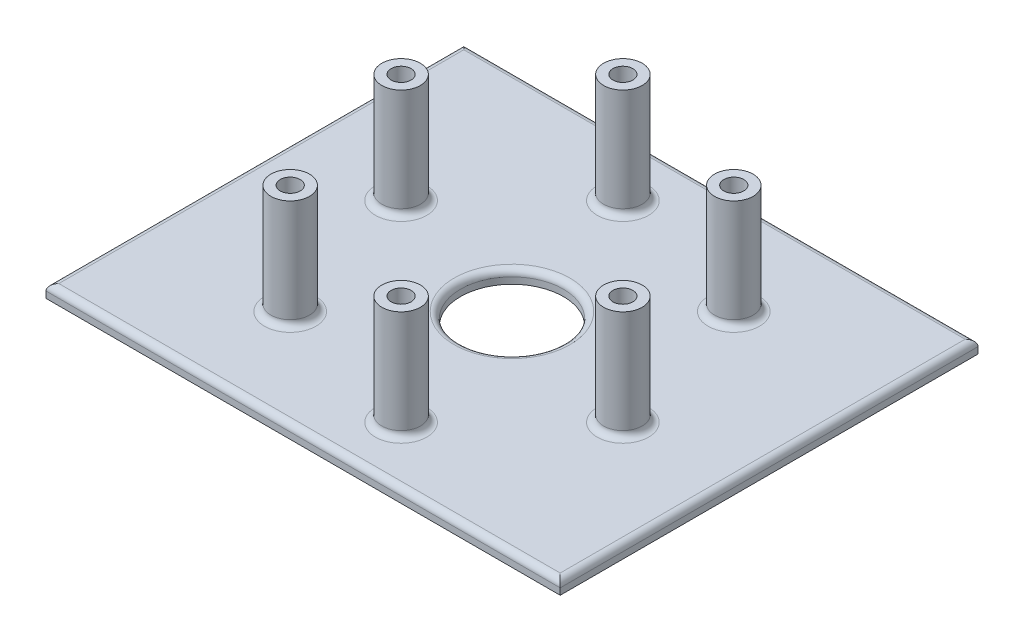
ISO-10303-21;
HEADER;
FILE_DESCRIPTION(('STEP AP214'),'2;1');
FILE_NAME('part.step','',(''),(''),'','','');
FILE_SCHEMA(('AUTOMOTIVE_DESIGN { 1 0 10303 214 1 1 1 1 }'));
ENDSEC;
DATA;
#1=APPLICATION_CONTEXT('core data for automotive mechanical design processes');
#2=APPLICATION_PROTOCOL_DEFINITION('international standard','automotive_design',2000,#1);
#3=PRODUCT_CONTEXT('',#1,'mechanical');
#4=PRODUCT('Part','Part','',(#3));
#5=PRODUCT_RELATED_PRODUCT_CATEGORY('part','',(#4));
#6=PRODUCT_DEFINITION_FORMATION('','',#4);
#7=PRODUCT_DEFINITION_CONTEXT('part definition',#1,'design');
#8=PRODUCT_DEFINITION('design','',#6,#7);
#9=PRODUCT_DEFINITION_SHAPE('','',#8);
#10=(LENGTH_UNIT() NAMED_UNIT(*) SI_UNIT(.MILLI.,.METRE.));
#11=(NAMED_UNIT(*) PLANE_ANGLE_UNIT() SI_UNIT($,.RADIAN.));
#12=(NAMED_UNIT(*) SI_UNIT($,.STERADIAN.) SOLID_ANGLE_UNIT());
#13=UNCERTAINTY_MEASURE_WITH_UNIT(LENGTH_MEASURE(1.E-05),#10,'distance_accuracy_value','');
#14=(GEOMETRIC_REPRESENTATION_CONTEXT(3) GLOBAL_UNCERTAINTY_ASSIGNED_CONTEXT((#13)) GLOBAL_UNIT_ASSIGNED_CONTEXT((#10,
#11,#12)) REPRESENTATION_CONTEXT('',''));
#15=CARTESIAN_POINT('',(0.,0.,0.));
#16=DIRECTION('',(0.,0.,1.));
#17=DIRECTION('',(1.,0.,0.));
#18=AXIS2_PLACEMENT_3D('',#15,#16,#17);
#19=CARTESIAN_POINT('',(40.,-2.,32.5));
#20=DIRECTION('',(1.,0.,0.));
#21=DIRECTION('',(0.,0.,-1.));
#22=AXIS2_PLACEMENT_3D('',#19,#20,#21);
#23=PLANE('',#22);
#24=DIRECTION('',(0.,1.,0.));
#25=VECTOR('',#24,1.);
#26=CARTESIAN_POINT('',(40.,-2.,-32.5));
#27=LINE('',#26,#25);
#28=CARTESIAN_POINT('',(40.,-2.,-32.5));
#29=VERTEX_POINT('',#28);
#30=CARTESIAN_POINT('',(40.,-1.,-32.5));
#31=VERTEX_POINT('',#30);
#32=EDGE_CURVE('E96',#29,#31,#27,.T.);
#33=ORIENTED_EDGE('',*,*,#32,.T.);
#34=DIRECTION('',(0.,0.,-1.));
#35=VECTOR('',#34,1.);
#36=CARTESIAN_POINT('',(40.,-1.,32.5));
#37=LINE('',#36,#35);
#38=CARTESIAN_POINT('',(40.,-1.,32.5));
#39=VERTEX_POINT('',#38);
#40=EDGE_CURVE('E51',#31,#39,#37,.F.);
#41=ORIENTED_EDGE('',*,*,#40,.T.);
#42=DIRECTION('',(0.,1.,0.));
#43=VECTOR('',#42,1.);
#44=CARTESIAN_POINT('',(40.,-2.,32.5));
#45=LINE('',#44,#43);
#46=CARTESIAN_POINT('',(40.,-2.,32.5));
#47=VERTEX_POINT('',#46);
#48=EDGE_CURVE('E117',#47,#39,#45,.T.);
#49=ORIENTED_EDGE('',*,*,#48,.F.);
#50=DIRECTION('',(0.,0.,-1.));
#51=VECTOR('',#50,1.);
#52=CARTESIAN_POINT('',(40.,-2.,32.5));
#53=LINE('',#52,#51);
#54=EDGE_CURVE('E111',#47,#29,#53,.T.);
#55=ORIENTED_EDGE('',*,*,#54,.T.);
#56=EDGE_LOOP('',(#33,#41,#49,#55));
#57=FACE_BOUND('',#56,.T.);
#58=ADVANCED_FACE('F42',(#57),#23,.T.);
#59=CARTESIAN_POINT('',(-40.,-2.,32.5));
#60=DIRECTION('',(0.,0.,1.));
#61=DIRECTION('',(1.,0.,0.));
#62=AXIS2_PLACEMENT_3D('',#59,#60,#61);
#63=PLANE('',#62);
#64=ORIENTED_EDGE('',*,*,#48,.T.);
#65=DIRECTION('',(1.,0.,0.));
#66=VECTOR('',#65,1.);
#67=CARTESIAN_POINT('',(-40.,-1.,32.5));
#68=LINE('',#67,#66);
#69=CARTESIAN_POINT('',(-40.,-1.,32.5));
#70=VERTEX_POINT('',#69);
#71=EDGE_CURVE('E179',#39,#70,#68,.F.);
#72=ORIENTED_EDGE('',*,*,#71,.T.);
#73=DIRECTION('',(0.,1.,0.));
#74=VECTOR('',#73,1.);
#75=CARTESIAN_POINT('',(-40.,-2.,32.5));
#76=LINE('',#75,#74);
#77=CARTESIAN_POINT('',(-40.,-2.,32.5));
#78=VERTEX_POINT('',#77);
#79=EDGE_CURVE('E129',#78,#70,#76,.T.);
#80=ORIENTED_EDGE('',*,*,#79,.F.);
#81=DIRECTION('',(1.,0.,0.));
#82=VECTOR('',#81,1.);
#83=CARTESIAN_POINT('',(-40.,-2.,32.5));
#84=LINE('',#83,#82);
#85=EDGE_CURVE('E104',#78,#47,#84,.T.);
#86=ORIENTED_EDGE('',*,*,#85,.T.);
#87=EDGE_LOOP('',(#64,#72,#80,#86));
#88=FACE_BOUND('',#87,.T.);
#89=ADVANCED_FACE('F274',(#88),#63,.T.);
#90=CARTESIAN_POINT('',(-40.,-2.,32.5));
#91=DIRECTION('',(-1.,0.,0.));
#92=DIRECTION('',(0.,0.,1.));
#93=AXIS2_PLACEMENT_3D('',#90,#91,#92);
#94=PLANE('',#93);
#95=ORIENTED_EDGE('',*,*,#79,.T.);
#96=DIRECTION('',(0.,0.,1.));
#97=VECTOR('',#96,1.);
#98=CARTESIAN_POINT('',(-40.,-1.,-32.5));
#99=LINE('',#98,#97);
#100=CARTESIAN_POINT('',(-40.,-1.,-32.5));
#101=VERTEX_POINT('',#100);
#102=EDGE_CURVE('E67',#70,#101,#99,.F.);
#103=ORIENTED_EDGE('',*,*,#102,.T.);
#104=DIRECTION('',(0.,1.,0.));
#105=VECTOR('',#104,1.);
#106=CARTESIAN_POINT('',(-40.,-2.,-32.5));
#107=LINE('',#106,#105);
#108=CARTESIAN_POINT('',(-40.,-2.,-32.5));
#109=VERTEX_POINT('',#108);
#110=EDGE_CURVE('E103',#109,#101,#107,.T.);
#111=ORIENTED_EDGE('',*,*,#110,.F.);
#112=DIRECTION('',(0.,0.,1.));
#113=VECTOR('',#112,1.);
#114=CARTESIAN_POINT('',(-40.,-2.,32.5));
#115=LINE('',#114,#113);
#116=EDGE_CURVE('E114',#109,#78,#115,.T.);
#117=ORIENTED_EDGE('',*,*,#116,.T.);
#118=EDGE_LOOP('',(#95,#103,#111,#117));
#119=FACE_BOUND('',#118,.T.);
#120=ADVANCED_FACE('F280',(#119),#94,.T.);
#121=CARTESIAN_POINT('',(-40.,-2.,-32.5));
#122=DIRECTION('',(0.,0.,-1.));
#123=DIRECTION('',(-1.,0.,0.));
#124=AXIS2_PLACEMENT_3D('',#121,#122,#123);
#125=PLANE('',#124);
#126=ORIENTED_EDGE('',*,*,#110,.T.);
#127=DIRECTION('',(-1.,0.,0.));
#128=VECTOR('',#127,1.);
#129=CARTESIAN_POINT('',(40.,-1.,-32.5));
#130=LINE('',#129,#128);
#131=EDGE_CURVE('E59',#101,#31,#130,.F.);
#132=ORIENTED_EDGE('',*,*,#131,.T.);
#133=ORIENTED_EDGE('',*,*,#32,.F.);
#134=DIRECTION('',(-1.,0.,0.));
#135=VECTOR('',#134,1.);
#136=CARTESIAN_POINT('',(-40.,-2.,-32.5));
#137=LINE('',#136,#135);
#138=EDGE_CURVE('E99',#29,#109,#137,.T.);
#139=ORIENTED_EDGE('',*,*,#138,.T.);
#140=EDGE_LOOP('',(#126,#132,#133,#139));
#141=FACE_BOUND('',#140,.T.);
#142=ADVANCED_FACE('F98',(#141),#125,.T.);
#143=CARTESIAN_POINT('',(0.,-2.,0.));
#144=DIRECTION('',(0.,-1.,0.));
#145=DIRECTION('',(0.,0.,-1.));
#146=AXIS2_PLACEMENT_3D('',#143,#144,#145);
#147=PLANE('',#146);
#148=CARTESIAN_POINT('',(0.,-2.,0.));
#149=DIRECTION('',(0.,1.,0.));
#150=DIRECTION('',(0.,0.,1.));
#151=AXIS2_PLACEMENT_3D('',#148,#149,#150);
#152=CIRCLE('',#151,8.);
#153=CARTESIAN_POINT('',(0.,-2.,8.));
#154=VERTEX_POINT('',#153);
#155=EDGE_CURVE('E194',#154,#154,#152,.T.);
#156=ORIENTED_EDGE('',*,*,#155,.T.);
#157=EDGE_LOOP('',(#156));
#158=FACE_BOUND('',#157,.T.);
#159=ORIENTED_EDGE('',*,*,#54,.F.);
#160=ORIENTED_EDGE('',*,*,#85,.F.);
#161=ORIENTED_EDGE('',*,*,#116,.F.);
#162=ORIENTED_EDGE('',*,*,#138,.F.);
#163=EDGE_LOOP('',(#159,#160,#161,#162));
#164=FACE_BOUND('',#163,.T.);
#165=ADVANCED_FACE('F109',(#158,#164),#147,.T.);
#166=CARTESIAN_POINT('',(0.,0.,0.));
#167=DIRECTION('',(0.,-1.,0.));
#168=DIRECTION('',(0.,0.,-1.));
#169=AXIS2_PLACEMENT_3D('',#166,#167,#168);
#170=PLANE('',#169);
#171=DIRECTION('',(0.,0.,1.));
#172=VECTOR('',#171,1.);
#173=CARTESIAN_POINT('',(-39.,0.,32.5));
#174=LINE('',#173,#172);
#175=CARTESIAN_POINT('',(-39.,0.,-31.5));
#176=VERTEX_POINT('',#175);
#177=CARTESIAN_POINT('',(-39.,0.,31.5));
#178=VERTEX_POINT('',#177);
#179=EDGE_CURVE('E174',#176,#178,#174,.T.);
#180=ORIENTED_EDGE('',*,*,#179,.T.);
#181=DIRECTION('',(1.,0.,0.));
#182=VECTOR('',#181,1.);
#183=CARTESIAN_POINT('',(40.,0.,31.5));
#184=LINE('',#183,#182);
#185=CARTESIAN_POINT('',(39.,0.,31.5));
#186=VERTEX_POINT('',#185);
#187=EDGE_CURVE('E176',#178,#186,#184,.T.);
#188=ORIENTED_EDGE('',*,*,#187,.T.);
#189=DIRECTION('',(0.,0.,-1.));
#190=VECTOR('',#189,1.);
#191=CARTESIAN_POINT('',(39.,0.,-32.5));
#192=LINE('',#191,#190);
#193=CARTESIAN_POINT('',(39.,0.,-31.5));
#194=VERTEX_POINT('',#193);
#195=EDGE_CURVE('E170',#186,#194,#192,.T.);
#196=ORIENTED_EDGE('',*,*,#195,.T.);
#197=DIRECTION('',(-1.,0.,0.));
#198=VECTOR('',#197,1.);
#199=CARTESIAN_POINT('',(-40.,0.,-31.5));
#200=LINE('',#199,#198);
#201=EDGE_CURVE('E172',#194,#176,#200,.T.);
#202=ORIENTED_EDGE('',*,*,#201,.T.);
#203=EDGE_LOOP('',(#180,#188,#196,#202));
#204=FACE_BOUND('',#203,.T.);
#205=CARTESIAN_POINT('',(0.,0.,0.));
#206=DIRECTION('',(0.,-1.,0.));
#207=DIRECTION('',(0.,0.,-1.));
#208=AXIS2_PLACEMENT_3D('',#205,#206,#207);
#209=CIRCLE('',#208,9.);
#210=CARTESIAN_POINT('',(0.,0.,-9.));
#211=VERTEX_POINT('',#210);
#212=EDGE_CURVE('E167',#211,#211,#209,.T.);
#213=ORIENTED_EDGE('',*,*,#212,.T.);
#214=EDGE_LOOP('',(#213));
#215=FACE_BOUND('',#214,.T.);
#216=CARTESIAN_POINT('',(-6.31518470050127,0.,-23.5685901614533));
#217=DIRECTION('',(0.,-1.,0.));
#218=DIRECTION('',(0.,0.,-1.));
#219=AXIS2_PLACEMENT_3D('',#216,#217,#218);
#220=CIRCLE('',#219,4.);
#221=CARTESIAN_POINT('',(-6.31518470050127,0.,-27.5685901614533));
#222=VERTEX_POINT('',#221);
#223=EDGE_CURVE('E164',#222,#222,#220,.T.);
#224=ORIENTED_EDGE('',*,*,#223,.T.);
#225=EDGE_LOOP('',(#224));
#226=FACE_BOUND('',#225,.T.);
#227=CARTESIAN_POINT('',(-23.5685901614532,0.,-6.31518470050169));
#228=DIRECTION('',(0.,-1.,0.));
#229=DIRECTION('',(0.,0.,-1.));
#230=AXIS2_PLACEMENT_3D('',#227,#228,#229);
#231=CIRCLE('',#230,4.);
#232=CARTESIAN_POINT('',(-23.5685901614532,0.,-10.3151847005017));
#233=VERTEX_POINT('',#232);
#234=EDGE_CURVE('E158',#233,#233,#231,.T.);
#235=ORIENTED_EDGE('',*,*,#234,.T.);
#236=EDGE_LOOP('',(#235));
#237=FACE_BOUND('',#236,.T.);
#238=CARTESIAN_POINT('',(-17.2534054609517,0.,17.2534054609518));
#239=DIRECTION('',(0.,-1.,0.));
#240=DIRECTION('',(0.,0.,-1.));
#241=AXIS2_PLACEMENT_3D('',#238,#239,#240);
#242=CIRCLE('',#241,4.);
#243=CARTESIAN_POINT('',(-17.2534054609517,0.,13.2534054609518));
#244=VERTEX_POINT('',#243);
#245=EDGE_CURVE('E152',#244,#244,#242,.T.);
#246=ORIENTED_EDGE('',*,*,#245,.T.);
#247=EDGE_LOOP('',(#246));
#248=FACE_BOUND('',#247,.T.);
#249=CARTESIAN_POINT('',(6.31518470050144,0.,23.5685901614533));
#250=DIRECTION('',(0.,-1.,0.));
#251=DIRECTION('',(0.,0.,-1.));
#252=AXIS2_PLACEMENT_3D('',#249,#250,#251);
#253=CIRCLE('',#252,4.);
#254=CARTESIAN_POINT('',(6.31518470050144,0.,19.5685901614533));
#255=VERTEX_POINT('',#254);
#256=EDGE_CURVE('E146',#255,#255,#253,.T.);
#257=ORIENTED_EDGE('',*,*,#256,.T.);
#258=EDGE_LOOP('',(#257));
#259=FACE_BOUND('',#258,.T.);
#260=CARTESIAN_POINT('',(23.5685901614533,0.,6.31518470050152));
#261=DIRECTION('',(0.,-1.,0.));
#262=DIRECTION('',(0.,0.,-1.));
#263=AXIS2_PLACEMENT_3D('',#260,#261,#262);
#264=CIRCLE('',#263,4.);
#265=CARTESIAN_POINT('',(23.5685901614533,0.,2.31518470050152));
#266=VERTEX_POINT('',#265);
#267=EDGE_CURVE('E140',#266,#266,#264,.T.);
#268=ORIENTED_EDGE('',*,*,#267,.T.);
#269=EDGE_LOOP('',(#268));
#270=FACE_BOUND('',#269,.T.);
#271=CARTESIAN_POINT('',(17.2534054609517,0.,-17.2534054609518));
#272=DIRECTION('',(0.,-1.,0.));
#273=DIRECTION('',(0.,0.,-1.));
#274=AXIS2_PLACEMENT_3D('',#271,#272,#273);
#275=CIRCLE('',#274,4.);
#276=CARTESIAN_POINT('',(17.2534054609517,0.,-21.2534054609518));
#277=VERTEX_POINT('',#276);
#278=EDGE_CURVE('E134',#277,#277,#275,.T.);
#279=ORIENTED_EDGE('',*,*,#278,.T.);
#280=EDGE_LOOP('',(#279));
#281=FACE_BOUND('',#280,.T.);
#282=ADVANCED_FACE('F263',(#204,#215,#226,#237,#248,#259,#270,#281),#170,.F.);
#283=CARTESIAN_POINT('',(17.2534054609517,17.,-17.2534054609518));
#284=DIRECTION('',(0.,-1.,0.));
#285=DIRECTION('',(0.,0.,-1.));
#286=AXIS2_PLACEMENT_3D('',#283,#284,#285);
#287=CYLINDRICAL_SURFACE('',#286,3.);
#288=CARTESIAN_POINT('',(17.2534054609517,1.,-17.2534054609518));
#289=DIRECTION('',(0.,-1.,0.));
#290=DIRECTION('',(0.,0.,-1.));
#291=AXIS2_PLACEMENT_3D('',#288,#289,#290);
#292=CIRCLE('',#291,3.);
#293=CARTESIAN_POINT('',(17.2534054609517,1.,-20.2534054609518));
#294=VERTEX_POINT('',#293);
#295=EDGE_CURVE('E128',#294,#294,#292,.F.);
#296=ORIENTED_EDGE('',*,*,#295,.T.);
#297=EDGE_LOOP('',(#296));
#298=FACE_BOUND('',#297,.T.);
#299=CARTESIAN_POINT('',(17.2534054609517,17.,-17.2534054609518));
#300=DIRECTION('',(0.,1.,0.));
#301=DIRECTION('',(0.,0.,1.));
#302=AXIS2_PLACEMENT_3D('',#299,#300,#301);
#303=CIRCLE('',#302,3.);
#304=CARTESIAN_POINT('',(17.2534054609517,17.,-14.2534054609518));
#305=VERTEX_POINT('',#304);
#306=EDGE_CURVE('E118',#305,#305,#303,.T.);
#307=ORIENTED_EDGE('',*,*,#306,.F.);
#308=EDGE_LOOP('',(#307));
#309=FACE_BOUND('',#308,.T.);
#310=ADVANCED_FACE('F258',(#298,#309),#287,.T.);
#311=CARTESIAN_POINT('',(17.2534054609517,17.,-17.2534054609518));
#312=DIRECTION('',(0.,1.,0.));
#313=DIRECTION('',(0.,0.,1.));
#314=AXIS2_PLACEMENT_3D('',#311,#312,#313);
#315=PLANE('',#314);
#316=CARTESIAN_POINT('',(17.2534054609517,17.,-17.2534054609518));
#317=DIRECTION('',(0.,1.,0.));
#318=DIRECTION('',(0.,0.,1.));
#319=AXIS2_PLACEMENT_3D('',#316,#317,#318);
#320=CIRCLE('',#319,1.55);
#321=CARTESIAN_POINT('',(17.2534054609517,17.,-15.7034054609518));
#322=VERTEX_POINT('',#321);
#323=EDGE_CURVE('E248',#322,#322,#320,.T.);
#324=ORIENTED_EDGE('',*,*,#323,.F.);
#325=EDGE_LOOP('',(#324));
#326=FACE_BOUND('',#325,.T.);
#327=ORIENTED_EDGE('',*,*,#306,.T.);
#328=EDGE_LOOP('',(#327));
#329=FACE_BOUND('',#328,.T.);
#330=ADVANCED_FACE('F255',(#326,#329),#315,.T.);
#331=CARTESIAN_POINT('',(17.2534054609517,12.,-17.2534054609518));
#332=DIRECTION('',(0.,1.,0.));
#333=DIRECTION('',(0.,0.,1.));
#334=AXIS2_PLACEMENT_3D('',#331,#332,#333);
#335=CYLINDRICAL_SURFACE('',#334,1.55);
#336=CARTESIAN_POINT('',(17.2534054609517,12.,-17.2534054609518));
#337=DIRECTION('',(0.,1.,0.));
#338=DIRECTION('',(0.,0.,1.));
#339=AXIS2_PLACEMENT_3D('',#336,#337,#338);
#340=CIRCLE('',#339,1.55);
#341=CARTESIAN_POINT('',(17.2534054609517,12.,-15.7034054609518));
#342=VERTEX_POINT('',#341);
#343=EDGE_CURVE('E121',#342,#342,#340,.T.);
#344=ORIENTED_EDGE('',*,*,#343,.F.);
#345=EDGE_LOOP('',(#344));
#346=FACE_BOUND('',#345,.T.);
#347=ORIENTED_EDGE('',*,*,#323,.T.);
#348=EDGE_LOOP('',(#347));
#349=FACE_BOUND('',#348,.T.);
#350=ADVANCED_FACE('F253',(#346,#349),#335,.F.);
#351=CARTESIAN_POINT('',(17.2534054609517,12.,-17.2534054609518));
#352=DIRECTION('',(0.,1.,0.));
#353=DIRECTION('',(0.,0.,1.));
#354=AXIS2_PLACEMENT_3D('',#351,#352,#353);
#355=PLANE('',#354);
#356=ORIENTED_EDGE('',*,*,#343,.T.);
#357=EDGE_LOOP('',(#356));
#358=FACE_BOUND('',#357,.T.);
#359=ADVANCED_FACE('F290',(#358),#355,.T.);
#360=CARTESIAN_POINT('',(17.2534054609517,1.,-17.2534054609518));
#361=DIRECTION('',(0.,-1.,0.));
#362=DIRECTION('',(0.,0.,-1.));
#363=AXIS2_PLACEMENT_3D('',#360,#361,#362);
#364=TOROIDAL_SURFACE('',#363,4.,1.);
#365=ORIENTED_EDGE('',*,*,#278,.F.);
#366=EDGE_LOOP('',(#365));
#367=FACE_BOUND('',#366,.T.);
#368=ORIENTED_EDGE('',*,*,#295,.F.);
#369=EDGE_LOOP('',(#368));
#370=FACE_BOUND('',#369,.T.);
#371=ADVANCED_FACE('F286',(#367,#370),#364,.F.);
#372=CARTESIAN_POINT('',(23.5685901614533,17.,6.31518470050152));
#373=DIRECTION('',(0.,-1.,0.));
#374=DIRECTION('',(0.,0.,-1.));
#375=AXIS2_PLACEMENT_3D('',#372,#373,#374);
#376=CYLINDRICAL_SURFACE('',#375,3.);
#377=CARTESIAN_POINT('',(23.5685901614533,1.,6.31518470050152));
#378=DIRECTION('',(0.,-1.,0.));
#379=DIRECTION('',(0.,0.,-1.));
#380=AXIS2_PLACEMENT_3D('',#377,#378,#379);
#381=CIRCLE('',#380,3.);
#382=CARTESIAN_POINT('',(23.5685901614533,1.,3.31518470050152));
#383=VERTEX_POINT('',#382);
#384=EDGE_CURVE('E137',#383,#383,#381,.F.);
#385=ORIENTED_EDGE('',*,*,#384,.T.);
#386=EDGE_LOOP('',(#385));
#387=FACE_BOUND('',#386,.T.);
#388=CARTESIAN_POINT('',(23.5685901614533,17.,6.31518470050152));
#389=DIRECTION('',(0.,1.,0.));
#390=DIRECTION('',(-0.86602540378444,0.,0.499999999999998));
#391=AXIS2_PLACEMENT_3D('',#388,#389,#390);
#392=CIRCLE('',#391,3.);
#393=CARTESIAN_POINT('',(20.9705139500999,17.,7.81518470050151));
#394=VERTEX_POINT('',#393);
#395=EDGE_CURVE('E245',#394,#394,#392,.T.);
#396=ORIENTED_EDGE('',*,*,#395,.F.);
#397=EDGE_LOOP('',(#396));
#398=FACE_BOUND('',#397,.T.);
#399=ADVANCED_FACE('F289',(#387,#398),#376,.T.);
#400=CARTESIAN_POINT('',(23.5685901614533,17.,6.31518470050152));
#401=DIRECTION('',(0.,1.,0.));
#402=DIRECTION('',(-0.86602540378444,0.,0.499999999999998));
#403=AXIS2_PLACEMENT_3D('',#400,#401,#402);
#404=PLANE('',#403);
#405=CARTESIAN_POINT('',(23.5685901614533,17.,6.31518470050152));
#406=DIRECTION('',(0.,1.,0.));
#407=DIRECTION('',(-0.86602540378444,0.,0.499999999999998));
#408=AXIS2_PLACEMENT_3D('',#405,#406,#407);
#409=CIRCLE('',#408,1.55);
#410=CARTESIAN_POINT('',(22.2262507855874,17.,7.09018470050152));
#411=VERTEX_POINT('',#410);
#412=EDGE_CURVE('E211',#411,#411,#409,.T.);
#413=ORIENTED_EDGE('',*,*,#412,.F.);
#414=EDGE_LOOP('',(#413));
#415=FACE_BOUND('',#414,.T.);
#416=ORIENTED_EDGE('',*,*,#395,.T.);
#417=EDGE_LOOP('',(#416));
#418=FACE_BOUND('',#417,.T.);
#419=ADVANCED_FACE('F357',(#415,#418),#404,.T.);
#420=CARTESIAN_POINT('',(6.31518470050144,17.,23.5685901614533));
#421=DIRECTION('',(0.,-1.,0.));
#422=DIRECTION('',(0.,0.,-1.));
#423=AXIS2_PLACEMENT_3D('',#420,#421,#422);
#424=CYLINDRICAL_SURFACE('',#423,3.);
#425=CARTESIAN_POINT('',(6.31518470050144,1.,23.5685901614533));
#426=DIRECTION('',(0.,-1.,0.));
#427=DIRECTION('',(0.,0.,-1.));
#428=AXIS2_PLACEMENT_3D('',#425,#426,#427);
#429=CIRCLE('',#428,3.);
#430=CARTESIAN_POINT('',(6.31518470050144,1.,20.5685901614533));
#431=VERTEX_POINT('',#430);
#432=EDGE_CURVE('E143',#431,#431,#429,.F.);
#433=ORIENTED_EDGE('',*,*,#432,.T.);
#434=EDGE_LOOP('',(#433));
#435=FACE_BOUND('',#434,.T.);
#436=CARTESIAN_POINT('',(6.31518470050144,17.,23.5685901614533));
#437=DIRECTION('',(0.,1.,0.));
#438=DIRECTION('',(-0.866025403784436,0.,-0.500000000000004));
#439=AXIS2_PLACEMENT_3D('',#436,#437,#438);
#440=CIRCLE('',#439,3.);
#441=CARTESIAN_POINT('',(3.71710848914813,17.,22.0685901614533));
#442=VERTEX_POINT('',#441);
#443=EDGE_CURVE('E242',#442,#442,#440,.T.);
#444=ORIENTED_EDGE('',*,*,#443,.F.);
#445=EDGE_LOOP('',(#444));
#446=FACE_BOUND('',#445,.T.);
#447=ADVANCED_FACE('F362',(#435,#446),#424,.T.);
#448=CARTESIAN_POINT('',(6.31518470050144,17.,23.5685901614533));
#449=DIRECTION('',(0.,1.,0.));
#450=DIRECTION('',(-0.866025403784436,0.,-0.500000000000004));
#451=AXIS2_PLACEMENT_3D('',#448,#449,#450);
#452=PLANE('',#451);
#453=CARTESIAN_POINT('',(6.31518470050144,17.,23.5685901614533));
#454=DIRECTION('',(0.,1.,0.));
#455=DIRECTION('',(-0.866025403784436,0.,-0.500000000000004));
#456=AXIS2_PLACEMENT_3D('',#453,#454,#455);
#457=CIRCLE('',#456,1.55);
#458=CARTESIAN_POINT('',(4.97284532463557,17.,22.7935901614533));
#459=VERTEX_POINT('',#458);
#460=EDGE_CURVE('E217',#459,#459,#457,.T.);
#461=ORIENTED_EDGE('',*,*,#460,.F.);
#462=EDGE_LOOP('',(#461));
#463=FACE_BOUND('',#462,.T.);
#464=ORIENTED_EDGE('',*,*,#443,.T.);
#465=EDGE_LOOP('',(#464));
#466=FACE_BOUND('',#465,.T.);
#467=ADVANCED_FACE('F368',(#463,#466),#452,.T.);
#468=CARTESIAN_POINT('',(-17.2534054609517,17.,17.2534054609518));
#469=DIRECTION('',(0.,-1.,0.));
#470=DIRECTION('',(0.,0.,-1.));
#471=AXIS2_PLACEMENT_3D('',#468,#469,#470);
#472=CYLINDRICAL_SURFACE('',#471,3.);
#473=CARTESIAN_POINT('',(-17.2534054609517,1.,17.2534054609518));
#474=DIRECTION('',(0.,-1.,0.));
#475=DIRECTION('',(0.,0.,-1.));
#476=AXIS2_PLACEMENT_3D('',#473,#474,#475);
#477=CIRCLE('',#476,3.);
#478=CARTESIAN_POINT('',(-17.2534054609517,1.,14.2534054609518));
#479=VERTEX_POINT('',#478);
#480=EDGE_CURVE('E149',#479,#479,#477,.F.);
#481=ORIENTED_EDGE('',*,*,#480,.T.);
#482=EDGE_LOOP('',(#481));
#483=FACE_BOUND('',#482,.T.);
#484=CARTESIAN_POINT('',(-17.2534054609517,17.,17.2534054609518));
#485=DIRECTION('',(0.,1.,0.));
#486=DIRECTION('',(0.,0.,-1.));
#487=AXIS2_PLACEMENT_3D('',#484,#485,#486);
#488=CIRCLE('',#487,3.);
#489=CARTESIAN_POINT('',(-17.2534054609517,17.,14.2534054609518));
#490=VERTEX_POINT('',#489);
#491=EDGE_CURVE('E239',#490,#490,#488,.T.);
#492=ORIENTED_EDGE('',*,*,#491,.F.);
#493=EDGE_LOOP('',(#492));
#494=FACE_BOUND('',#493,.T.);
#495=ADVANCED_FACE('F418',(#483,#494),#472,.T.);
#496=CARTESIAN_POINT('',(-17.2534054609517,17.,17.2534054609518));
#497=DIRECTION('',(0.,1.,0.));
#498=DIRECTION('',(0.,0.,-1.));
#499=AXIS2_PLACEMENT_3D('',#496,#497,#498);
#500=PLANE('',#499);
#501=CARTESIAN_POINT('',(-17.2534054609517,17.,17.2534054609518));
#502=DIRECTION('',(0.,1.,0.));
#503=DIRECTION('',(0.,0.,-1.));
#504=AXIS2_PLACEMENT_3D('',#501,#502,#503);
#505=CIRCLE('',#504,1.55);
#506=CARTESIAN_POINT('',(-17.2534054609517,17.,15.7034054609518));
#507=VERTEX_POINT('',#506);
#508=EDGE_CURVE('E223',#507,#507,#505,.T.);
#509=ORIENTED_EDGE('',*,*,#508,.F.);
#510=EDGE_LOOP('',(#509));
#511=FACE_BOUND('',#510,.T.);
#512=ORIENTED_EDGE('',*,*,#491,.T.);
#513=EDGE_LOOP('',(#512));
#514=FACE_BOUND('',#513,.T.);
#515=ADVANCED_FACE('F428',(#511,#514),#500,.T.);
#516=CARTESIAN_POINT('',(-23.5685901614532,17.,-6.31518470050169));
#517=DIRECTION('',(0.,-1.,0.));
#518=DIRECTION('',(0.,0.,-1.));
#519=AXIS2_PLACEMENT_3D('',#516,#517,#518);
#520=CYLINDRICAL_SURFACE('',#519,3.);
#521=CARTESIAN_POINT('',(-23.5685901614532,1.,-6.31518470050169));
#522=DIRECTION('',(0.,-1.,0.));
#523=DIRECTION('',(0.,0.,-1.));
#524=AXIS2_PLACEMENT_3D('',#521,#522,#523);
#525=CIRCLE('',#524,3.);
#526=CARTESIAN_POINT('',(-23.5685901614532,1.,-9.31518470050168));
#527=VERTEX_POINT('',#526);
#528=EDGE_CURVE('E155',#527,#527,#525,.F.);
#529=ORIENTED_EDGE('',*,*,#528,.T.);
#530=EDGE_LOOP('',(#529));
#531=FACE_BOUND('',#530,.T.);
#532=CARTESIAN_POINT('',(-23.5685901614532,17.,-6.31518470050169));
#533=DIRECTION('',(0.,1.,0.));
#534=DIRECTION('',(0.866025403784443,0.,-0.499999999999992));
#535=AXIS2_PLACEMENT_3D('',#532,#533,#534);
#536=CIRCLE('',#535,3.);
#537=CARTESIAN_POINT('',(-20.9705139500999,17.,-7.81518470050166));
#538=VERTEX_POINT('',#537);
#539=EDGE_CURVE('E236',#538,#538,#536,.T.);
#540=ORIENTED_EDGE('',*,*,#539,.F.);
#541=EDGE_LOOP('',(#540));
#542=FACE_BOUND('',#541,.T.);
#543=ADVANCED_FACE('F439',(#531,#542),#520,.T.);
#544=CARTESIAN_POINT('',(-23.5685901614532,17.,-6.31518470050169));
#545=DIRECTION('',(0.,1.,0.));
#546=DIRECTION('',(0.866025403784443,0.,-0.499999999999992));
#547=AXIS2_PLACEMENT_3D('',#544,#545,#546);
#548=PLANE('',#547);
#549=CARTESIAN_POINT('',(-23.5685901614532,17.,-6.31518470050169));
#550=DIRECTION('',(0.,1.,0.));
#551=DIRECTION('',(0.866025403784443,0.,-0.499999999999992));
#552=AXIS2_PLACEMENT_3D('',#549,#550,#551);
#553=CIRCLE('',#552,1.55);
#554=CARTESIAN_POINT('',(-22.2262507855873,17.,-7.09018470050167));
#555=VERTEX_POINT('',#554);
#556=EDGE_CURVE('E229',#555,#555,#553,.T.);
#557=ORIENTED_EDGE('',*,*,#556,.F.);
#558=EDGE_LOOP('',(#557));
#559=FACE_BOUND('',#558,.T.);
#560=ORIENTED_EDGE('',*,*,#539,.T.);
#561=EDGE_LOOP('',(#560));
#562=FACE_BOUND('',#561,.T.);
#563=ADVANCED_FACE('F450',(#559,#562),#548,.T.);
#564=CARTESIAN_POINT('',(-6.31518470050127,17.,-23.5685901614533));
#565=DIRECTION('',(0.,-1.,0.));
#566=DIRECTION('',(0.,0.,-1.));
#567=AXIS2_PLACEMENT_3D('',#564,#565,#566);
#568=CYLINDRICAL_SURFACE('',#567,3.);
#569=CARTESIAN_POINT('',(-6.31518470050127,1.,-23.5685901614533));
#570=DIRECTION('',(0.,-1.,0.));
#571=DIRECTION('',(0.,0.,-1.));
#572=AXIS2_PLACEMENT_3D('',#569,#570,#571);
#573=CIRCLE('',#572,3.);
#574=CARTESIAN_POINT('',(-6.31518470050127,1.,-26.5685901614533));
#575=VERTEX_POINT('',#574);
#576=EDGE_CURVE('E161',#575,#575,#573,.F.);
#577=ORIENTED_EDGE('',*,*,#576,.T.);
#578=EDGE_LOOP('',(#577));
#579=FACE_BOUND('',#578,.T.);
#580=CARTESIAN_POINT('',(-6.31518470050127,17.,-23.5685901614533));
#581=DIRECTION('',(0.,1.,0.));
#582=DIRECTION('',(0.866025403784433,0.,0.50000000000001));
#583=AXIS2_PLACEMENT_3D('',#580,#581,#582);
#584=CIRCLE('',#583,3.);
#585=CARTESIAN_POINT('',(-3.71710848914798,17.,-22.0685901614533));
#586=VERTEX_POINT('',#585);
#587=EDGE_CURVE('E210',#586,#586,#584,.T.);
#588=ORIENTED_EDGE('',*,*,#587,.F.);
#589=EDGE_LOOP('',(#588));
#590=FACE_BOUND('',#589,.T.);
#591=ADVANCED_FACE('F461',(#579,#590),#568,.T.);
#592=CARTESIAN_POINT('',(-6.31518470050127,17.,-23.5685901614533));
#593=DIRECTION('',(0.,1.,0.));
#594=DIRECTION('',(0.866025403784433,0.,0.50000000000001));
#595=AXIS2_PLACEMENT_3D('',#592,#593,#594);
#596=PLANE('',#595);
#597=CARTESIAN_POINT('',(-6.31518470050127,17.,-23.5685901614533));
#598=DIRECTION('',(0.,1.,0.));
#599=DIRECTION('',(0.866025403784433,0.,0.50000000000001));
#600=AXIS2_PLACEMENT_3D('',#597,#598,#599);
#601=CIRCLE('',#600,1.55);
#602=CARTESIAN_POINT('',(-4.9728453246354,17.,-22.7935901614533));
#603=VERTEX_POINT('',#602);
#604=EDGE_CURVE('E199',#603,#603,#601,.T.);
#605=ORIENTED_EDGE('',*,*,#604,.F.);
#606=EDGE_LOOP('',(#605));
#607=FACE_BOUND('',#606,.T.);
#608=ORIENTED_EDGE('',*,*,#587,.T.);
#609=EDGE_LOOP('',(#608));
#610=FACE_BOUND('',#609,.T.);
#611=ADVANCED_FACE('F472',(#607,#610),#596,.T.);
#612=CARTESIAN_POINT('',(-6.31518470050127,12.,-23.5685901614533));
#613=DIRECTION('',(0.,1.,0.));
#614=DIRECTION('',(0.,0.,1.));
#615=AXIS2_PLACEMENT_3D('',#612,#613,#614);
#616=CYLINDRICAL_SURFACE('',#615,1.55);
#617=CARTESIAN_POINT('',(-6.31518470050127,12.,-23.5685901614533));
#618=DIRECTION('',(0.,1.,0.));
#619=DIRECTION('',(0.866025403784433,0.,0.50000000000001));
#620=AXIS2_PLACEMENT_3D('',#617,#618,#619);
#621=CIRCLE('',#620,1.55);
#622=CARTESIAN_POINT('',(-4.9728453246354,12.,-22.7935901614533));
#623=VERTEX_POINT('',#622);
#624=EDGE_CURVE('E204',#623,#623,#621,.T.);
#625=ORIENTED_EDGE('',*,*,#624,.F.);
#626=EDGE_LOOP('',(#625));
#627=FACE_BOUND('',#626,.T.);
#628=ORIENTED_EDGE('',*,*,#604,.T.);
#629=EDGE_LOOP('',(#628));
#630=FACE_BOUND('',#629,.T.);
#631=ADVANCED_FACE('F483',(#627,#630),#616,.F.);
#632=CARTESIAN_POINT('',(-6.31518470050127,12.,-23.5685901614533));
#633=DIRECTION('',(0.,1.,0.));
#634=DIRECTION('',(0.866025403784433,0.,0.50000000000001));
#635=AXIS2_PLACEMENT_3D('',#632,#633,#634);
#636=PLANE('',#635);
#637=ORIENTED_EDGE('',*,*,#624,.T.);
#638=EDGE_LOOP('',(#637));
#639=FACE_BOUND('',#638,.T.);
#640=ADVANCED_FACE('F494',(#639),#636,.T.);
#641=CARTESIAN_POINT('',(-23.5685901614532,12.,-6.31518470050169));
#642=DIRECTION('',(0.,1.,0.));
#643=DIRECTION('',(0.,0.,1.));
#644=AXIS2_PLACEMENT_3D('',#641,#642,#643);
#645=CYLINDRICAL_SURFACE('',#644,1.55);
#646=CARTESIAN_POINT('',(-23.5685901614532,12.,-6.31518470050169));
#647=DIRECTION('',(0.,1.,0.));
#648=DIRECTION('',(0.866025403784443,0.,-0.499999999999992));
#649=AXIS2_PLACEMENT_3D('',#646,#647,#648);
#650=CIRCLE('',#649,1.55);
#651=CARTESIAN_POINT('',(-22.2262507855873,12.,-7.09018470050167));
#652=VERTEX_POINT('',#651);
#653=EDGE_CURVE('E226',#652,#652,#650,.T.);
#654=ORIENTED_EDGE('',*,*,#653,.F.);
#655=EDGE_LOOP('',(#654));
#656=FACE_BOUND('',#655,.T.);
#657=ORIENTED_EDGE('',*,*,#556,.T.);
#658=EDGE_LOOP('',(#657));
#659=FACE_BOUND('',#658,.T.);
#660=ADVANCED_FACE('F505',(#656,#659),#645,.F.);
#661=CARTESIAN_POINT('',(-23.5685901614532,12.,-6.31518470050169));
#662=DIRECTION('',(0.,1.,0.));
#663=DIRECTION('',(0.866025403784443,0.,-0.499999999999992));
#664=AXIS2_PLACEMENT_3D('',#661,#662,#663);
#665=PLANE('',#664);
#666=ORIENTED_EDGE('',*,*,#653,.T.);
#667=EDGE_LOOP('',(#666));
#668=FACE_BOUND('',#667,.T.);
#669=ADVANCED_FACE('F516',(#668),#665,.T.);
#670=CARTESIAN_POINT('',(-17.2534054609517,12.,17.2534054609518));
#671=DIRECTION('',(0.,1.,0.));
#672=DIRECTION('',(0.,0.,1.));
#673=AXIS2_PLACEMENT_3D('',#670,#671,#672);
#674=CYLINDRICAL_SURFACE('',#673,1.55);
#675=CARTESIAN_POINT('',(-17.2534054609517,12.,17.2534054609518));
#676=DIRECTION('',(0.,1.,0.));
#677=DIRECTION('',(0.,0.,-1.));
#678=AXIS2_PLACEMENT_3D('',#675,#676,#677);
#679=CIRCLE('',#678,1.55);
#680=CARTESIAN_POINT('',(-17.2534054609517,12.,15.7034054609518));
#681=VERTEX_POINT('',#680);
#682=EDGE_CURVE('E220',#681,#681,#679,.T.);
#683=ORIENTED_EDGE('',*,*,#682,.F.);
#684=EDGE_LOOP('',(#683));
#685=FACE_BOUND('',#684,.T.);
#686=ORIENTED_EDGE('',*,*,#508,.T.);
#687=EDGE_LOOP('',(#686));
#688=FACE_BOUND('',#687,.T.);
#689=ADVANCED_FACE('F527',(#685,#688),#674,.F.);
#690=CARTESIAN_POINT('',(-17.2534054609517,12.,17.2534054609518));
#691=DIRECTION('',(0.,1.,0.));
#692=DIRECTION('',(0.,0.,-1.));
#693=AXIS2_PLACEMENT_3D('',#690,#691,#692);
#694=PLANE('',#693);
#695=ORIENTED_EDGE('',*,*,#682,.T.);
#696=EDGE_LOOP('',(#695));
#697=FACE_BOUND('',#696,.T.);
#698=ADVANCED_FACE('F538',(#697),#694,.T.);
#699=CARTESIAN_POINT('',(6.31518470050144,12.,23.5685901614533));
#700=DIRECTION('',(0.,1.,0.));
#701=DIRECTION('',(0.,0.,1.));
#702=AXIS2_PLACEMENT_3D('',#699,#700,#701);
#703=CYLINDRICAL_SURFACE('',#702,1.55);
#704=CARTESIAN_POINT('',(6.31518470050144,12.,23.5685901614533));
#705=DIRECTION('',(0.,1.,0.));
#706=DIRECTION('',(-0.866025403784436,0.,-0.500000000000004));
#707=AXIS2_PLACEMENT_3D('',#704,#705,#706);
#708=CIRCLE('',#707,1.55);
#709=CARTESIAN_POINT('',(4.97284532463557,12.,22.7935901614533));
#710=VERTEX_POINT('',#709);
#711=EDGE_CURVE('E214',#710,#710,#708,.T.);
#712=ORIENTED_EDGE('',*,*,#711,.F.);
#713=EDGE_LOOP('',(#712));
#714=FACE_BOUND('',#713,.T.);
#715=ORIENTED_EDGE('',*,*,#460,.T.);
#716=EDGE_LOOP('',(#715));
#717=FACE_BOUND('',#716,.T.);
#718=ADVANCED_FACE('F549',(#714,#717),#703,.F.);
#719=CARTESIAN_POINT('',(6.31518470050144,12.,23.5685901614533));
#720=DIRECTION('',(0.,1.,0.));
#721=DIRECTION('',(-0.866025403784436,0.,-0.500000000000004));
#722=AXIS2_PLACEMENT_3D('',#719,#720,#721);
#723=PLANE('',#722);
#724=ORIENTED_EDGE('',*,*,#711,.T.);
#725=EDGE_LOOP('',(#724));
#726=FACE_BOUND('',#725,.T.);
#727=ADVANCED_FACE('F560',(#726),#723,.T.);
#728=CARTESIAN_POINT('',(23.5685901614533,12.,6.31518470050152));
#729=DIRECTION('',(0.,1.,0.));
#730=DIRECTION('',(0.,0.,1.));
#731=AXIS2_PLACEMENT_3D('',#728,#729,#730);
#732=CYLINDRICAL_SURFACE('',#731,1.55);
#733=CARTESIAN_POINT('',(23.5685901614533,12.,6.31518470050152));
#734=DIRECTION('',(0.,1.,0.));
#735=DIRECTION('',(-0.86602540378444,0.,0.499999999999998));
#736=AXIS2_PLACEMENT_3D('',#733,#734,#735);
#737=CIRCLE('',#736,1.55);
#738=CARTESIAN_POINT('',(22.2262507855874,12.,7.09018470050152));
#739=VERTEX_POINT('',#738);
#740=EDGE_CURVE('E207',#739,#739,#737,.T.);
#741=ORIENTED_EDGE('',*,*,#740,.F.);
#742=EDGE_LOOP('',(#741));
#743=FACE_BOUND('',#742,.T.);
#744=ORIENTED_EDGE('',*,*,#412,.T.);
#745=EDGE_LOOP('',(#744));
#746=FACE_BOUND('',#745,.T.);
#747=ADVANCED_FACE('F571',(#743,#746),#732,.F.);
#748=CARTESIAN_POINT('',(23.5685901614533,12.,6.31518470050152));
#749=DIRECTION('',(0.,1.,0.));
#750=DIRECTION('',(-0.86602540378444,0.,0.499999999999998));
#751=AXIS2_PLACEMENT_3D('',#748,#749,#750);
#752=PLANE('',#751);
#753=ORIENTED_EDGE('',*,*,#740,.T.);
#754=EDGE_LOOP('',(#753));
#755=FACE_BOUND('',#754,.T.);
#756=ADVANCED_FACE('F296',(#755),#752,.T.);
#757=CARTESIAN_POINT('',(23.5685901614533,1.,6.31518470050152));
#758=DIRECTION('',(0.,-1.,0.));
#759=DIRECTION('',(0.,0.,-1.));
#760=AXIS2_PLACEMENT_3D('',#757,#758,#759);
#761=TOROIDAL_SURFACE('',#760,4.,1.);
#762=ORIENTED_EDGE('',*,*,#267,.F.);
#763=EDGE_LOOP('',(#762));
#764=FACE_BOUND('',#763,.T.);
#765=ORIENTED_EDGE('',*,*,#384,.F.);
#766=EDGE_LOOP('',(#765));
#767=FACE_BOUND('',#766,.T.);
#768=ADVANCED_FACE('F292',(#764,#767),#761,.F.);
#769=CARTESIAN_POINT('',(6.31518470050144,1.,23.5685901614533));
#770=DIRECTION('',(0.,-1.,0.));
#771=DIRECTION('',(0.,0.,-1.));
#772=AXIS2_PLACEMENT_3D('',#769,#770,#771);
#773=TOROIDAL_SURFACE('',#772,4.,1.);
#774=ORIENTED_EDGE('',*,*,#256,.F.);
#775=EDGE_LOOP('',(#774));
#776=FACE_BOUND('',#775,.T.);
#777=ORIENTED_EDGE('',*,*,#432,.F.);
#778=EDGE_LOOP('',(#777));
#779=FACE_BOUND('',#778,.T.);
#780=ADVANCED_FACE('F295',(#776,#779),#773,.F.);
#781=CARTESIAN_POINT('',(-17.2534054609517,1.,17.2534054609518));
#782=DIRECTION('',(0.,-1.,0.));
#783=DIRECTION('',(0.,0.,-1.));
#784=AXIS2_PLACEMENT_3D('',#781,#782,#783);
#785=TOROIDAL_SURFACE('',#784,4.,1.);
#786=ORIENTED_EDGE('',*,*,#245,.F.);
#787=EDGE_LOOP('',(#786));
#788=FACE_BOUND('',#787,.T.);
#789=ORIENTED_EDGE('',*,*,#480,.F.);
#790=EDGE_LOOP('',(#789));
#791=FACE_BOUND('',#790,.T.);
#792=ADVANCED_FACE('F300',(#788,#791),#785,.F.);
#793=CARTESIAN_POINT('',(-23.5685901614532,1.,-6.31518470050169));
#794=DIRECTION('',(0.,-1.,0.));
#795=DIRECTION('',(0.,0.,-1.));
#796=AXIS2_PLACEMENT_3D('',#793,#794,#795);
#797=TOROIDAL_SURFACE('',#796,4.,1.);
#798=ORIENTED_EDGE('',*,*,#234,.F.);
#799=EDGE_LOOP('',(#798));
#800=FACE_BOUND('',#799,.T.);
#801=ORIENTED_EDGE('',*,*,#528,.F.);
#802=EDGE_LOOP('',(#801));
#803=FACE_BOUND('',#802,.T.);
#804=ADVANCED_FACE('F304',(#800,#803),#797,.F.);
#805=CARTESIAN_POINT('',(-6.31518470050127,1.,-23.5685901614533));
#806=DIRECTION('',(0.,-1.,0.));
#807=DIRECTION('',(0.,0.,-1.));
#808=AXIS2_PLACEMENT_3D('',#805,#806,#807);
#809=TOROIDAL_SURFACE('',#808,4.,1.);
#810=ORIENTED_EDGE('',*,*,#223,.F.);
#811=EDGE_LOOP('',(#810));
#812=FACE_BOUND('',#811,.T.);
#813=ORIENTED_EDGE('',*,*,#576,.F.);
#814=EDGE_LOOP('',(#813));
#815=FACE_BOUND('',#814,.T.);
#816=ADVANCED_FACE('F308',(#812,#815),#809,.F.);
#817=CARTESIAN_POINT('',(0.,-2.,0.));
#818=DIRECTION('',(0.,1.,0.));
#819=DIRECTION('',(0.,0.,1.));
#820=AXIS2_PLACEMENT_3D('',#817,#818,#819);
#821=CYLINDRICAL_SURFACE('',#820,8.);
#822=CARTESIAN_POINT('',(0.,-1.,0.));
#823=DIRECTION('',(0.,-1.,0.));
#824=DIRECTION('',(0.,0.,-1.));
#825=AXIS2_PLACEMENT_3D('',#822,#823,#824);
#826=CIRCLE('',#825,8.);
#827=CARTESIAN_POINT('',(0.,-1.,-8.));
#828=VERTEX_POINT('',#827);
#829=EDGE_CURVE('E11',#828,#828,#826,.F.);
#830=ORIENTED_EDGE('',*,*,#829,.T.);
#831=EDGE_LOOP('',(#830));
#832=FACE_BOUND('',#831,.T.);
#833=ORIENTED_EDGE('',*,*,#155,.F.);
#834=EDGE_LOOP('',(#833));
#835=FACE_BOUND('',#834,.T.);
#836=ADVANCED_FACE('F312',(#832,#835),#821,.F.);
#837=CARTESIAN_POINT('',(0.,-1.,-31.5));
#838=DIRECTION('',(1.,0.,0.));
#839=DIRECTION('',(0.,0.,-1.));
#840=AXIS2_PLACEMENT_3D('',#837,#838,#839);
#841=CYLINDRICAL_SURFACE('',#840,1.);
#842=CARTESIAN_POINT('',(39.,-1.,-31.5));
#843=DIRECTION('',(0.707106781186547,0.,0.707106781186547));
#844=DIRECTION('',(-0.707106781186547,0.,0.707106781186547));
#845=AXIS2_PLACEMENT_3D('',#842,#843,#844);
#846=ELLIPSE('',#845,1.41421356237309,1.);
#847=EDGE_CURVE('E188',#31,#194,#846,.T.);
#848=ORIENTED_EDGE('',*,*,#847,.F.);
#849=ORIENTED_EDGE('',*,*,#131,.F.);
#850=CARTESIAN_POINT('',(-39.,-1.,-31.5));
#851=DIRECTION('',(0.707106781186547,0.,-0.707106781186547));
#852=DIRECTION('',(0.707106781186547,0.,0.707106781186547));
#853=AXIS2_PLACEMENT_3D('',#850,#851,#852);
#854=ELLIPSE('',#853,1.41421356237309,1.);
#855=EDGE_CURVE('E46',#176,#101,#854,.F.);
#856=ORIENTED_EDGE('',*,*,#855,.F.);
#857=ORIENTED_EDGE('',*,*,#201,.F.);
#858=EDGE_LOOP('',(#848,#849,#856,#857));
#859=FACE_BOUND('',#858,.T.);
#860=ADVANCED_FACE('F323',(#859),#841,.T.);
#861=CARTESIAN_POINT('',(-39.,-1.,0.));
#862=DIRECTION('',(0.,0.,-1.));
#863=DIRECTION('',(-1.,0.,0.));
#864=AXIS2_PLACEMENT_3D('',#861,#862,#863);
#865=CYLINDRICAL_SURFACE('',#864,1.);
#866=ORIENTED_EDGE('',*,*,#855,.T.);
#867=ORIENTED_EDGE('',*,*,#102,.F.);
#868=CARTESIAN_POINT('',(-39.,-1.,31.5));
#869=DIRECTION('',(-0.707106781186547,0.,-0.707106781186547));
#870=DIRECTION('',(0.707106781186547,0.,-0.707106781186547));
#871=AXIS2_PLACEMENT_3D('',#868,#869,#870);
#872=ELLIPSE('',#871,1.41421356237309,1.);
#873=EDGE_CURVE('E187',#178,#70,#872,.F.);
#874=ORIENTED_EDGE('',*,*,#873,.F.);
#875=ORIENTED_EDGE('',*,*,#179,.F.);
#876=EDGE_LOOP('',(#866,#867,#874,#875));
#877=FACE_BOUND('',#876,.T.);
#878=ADVANCED_FACE('F321',(#877),#865,.T.);
#879=CARTESIAN_POINT('',(39.,-1.,0.));
#880=DIRECTION('',(0.,0.,1.));
#881=DIRECTION('',(1.,0.,0.));
#882=AXIS2_PLACEMENT_3D('',#879,#880,#881);
#883=CYLINDRICAL_SURFACE('',#882,1.);
#884=ORIENTED_EDGE('',*,*,#847,.T.);
#885=ORIENTED_EDGE('',*,*,#195,.F.);
#886=CARTESIAN_POINT('',(39.,-1.,31.5));
#887=DIRECTION('',(-0.707106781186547,0.,0.707106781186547));
#888=DIRECTION('',(0.707106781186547,0.,0.707106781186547));
#889=AXIS2_PLACEMENT_3D('',#886,#887,#888);
#890=ELLIPSE('',#889,1.41421356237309,1.);
#891=EDGE_CURVE('E185',#39,#186,#890,.T.);
#892=ORIENTED_EDGE('',*,*,#891,.F.);
#893=ORIENTED_EDGE('',*,*,#40,.F.);
#894=EDGE_LOOP('',(#884,#885,#892,#893));
#895=FACE_BOUND('',#894,.T.);
#896=ADVANCED_FACE('F317',(#895),#883,.T.);
#897=CARTESIAN_POINT('',(0.,-1.,31.5));
#898=DIRECTION('',(-1.,0.,0.));
#899=DIRECTION('',(0.,0.,1.));
#900=AXIS2_PLACEMENT_3D('',#897,#898,#899);
#901=CYLINDRICAL_SURFACE('',#900,1.);
#902=ORIENTED_EDGE('',*,*,#873,.T.);
#903=ORIENTED_EDGE('',*,*,#71,.F.);
#904=ORIENTED_EDGE('',*,*,#891,.T.);
#905=ORIENTED_EDGE('',*,*,#187,.F.);
#906=EDGE_LOOP('',(#902,#903,#904,#905));
#907=FACE_BOUND('',#906,.T.);
#908=ADVANCED_FACE('F314',(#907),#901,.T.);
#909=CARTESIAN_POINT('',(0.,-1.,0.));
#910=DIRECTION('',(0.,-1.,0.));
#911=DIRECTION('',(0.,0.,-1.));
#912=AXIS2_PLACEMENT_3D('',#909,#910,#911);
#913=TOROIDAL_SURFACE('',#912,9.,1.);
#914=ORIENTED_EDGE('',*,*,#212,.F.);
#915=EDGE_LOOP('',(#914));
#916=FACE_BOUND('',#915,.T.);
#917=ORIENTED_EDGE('',*,*,#829,.F.);
#918=EDGE_LOOP('',(#917));
#919=FACE_BOUND('',#918,.T.);
#920=ADVANCED_FACE('F44',(#916,#919),#913,.T.);
#921=CLOSED_SHELL('',(#58,#89,#120,#142,#165,#282,#310,#330,#350,#359,#371,#399,#419,#447,#467,
#495,#515,#543,#563,#591,#611,#631,#640,#660,#669,#689,#698,#718,#727,#747,#756,#768,#780,#792,
#804,#816,#836,#860,#878,#896,#908,#920));
#922=MANIFOLD_SOLID_BREP('B2',#921);
#923=ADVANCED_BREP_SHAPE_REPRESENTATION('',(#18,#922),#14);
#924=SHAPE_DEFINITION_REPRESENTATION(#9,#923);
ENDSEC;
END-ISO-10303-21;
